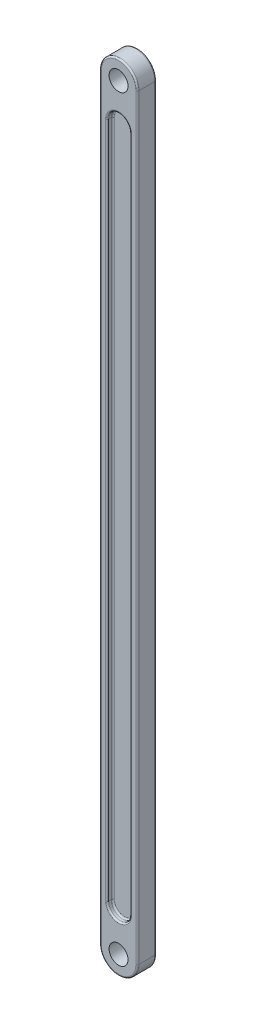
from build123d import *

# Parameters (mm, degrees)
SKETCH1_R      = 12.5
EXTRUDE1_DEPTH = 12.5
FILLET1_R      = 2
EXTRUDE2_START = 7.5
EXTRUDE2_DEPTH = 15
FILLET2_R      = 2


with BuildPart() as part:
    # Sketch1 → Extrude1 (new, symmetric)
    with BuildSketch(Plane.XY):
        with BuildLine():
            Line((25, 1000), (25, 0))
            ThreePointArc((25, 0), (0, -25), (-25, 0))
            Line((-25, 0), (-25, 1000))
            ThreePointArc((-25, 1000), (0, 1025), (25, 1000))
        make_face()
        Circle(SKETCH1_R, mode=Mode.SUBTRACT)
        with Locations((0, 1000)):
            Circle(SKETCH1_R, mode=Mode.SUBTRACT)
    extrude(amount=EXTRUDE1_DEPTH, both=True)

    # Fillet1
    fillet1_edges = [part.edges().sort_by_distance(p)[0] for p in [
        (0, -25, 12.5),
        (25, 500, 12.5),
        (0, 1025, 12.5),
        (25, 500, -12.5),
        (0, -25, -12.5),
        (-25, 500, -12.5),
        (0, 1025, -12.5),
        (-25, 500, 12.5),
    ]]
    fillet(fillet1_edges, radius=FILLET1_R)

    # Sketch2 → Extrude2 (cut)
    with BuildSketch(Plane(origin=(0, 0, -12.5), x_dir=(-1, 0, 0), z_dir=(0, 0, -1)).offset(EXTRUDE2_START)):
        with BuildLine():
            Line((15, 947.5), (15, 52.5))
            ThreePointArc((15, 52.5), (0, 37.5), (-15, 52.5))
            Line((-15, 52.5), (-15, 947.5))
            ThreePointArc((-15, 947.5), (0, 962.5), (15, 947.5))
        make_face()
    extrude2 = extrude(amount=-EXTRUDE2_DEPTH, mode=Mode.SUBTRACT)

    # Mirror1: Extrude2 across plane
    add(extrude2.mirror(Plane.XY), mode=Mode.SUBTRACT)

    # Fillet2
    fillet2_edges = [part.edges().sort_by_distance(p)[0] for p in [
        (15, 500, -12.5),
        (0, 37.5, -12.5),
        (-15, 500, -12.5),
        (0, 962.5, -12.5),
        (0, 962.5, -5),
        (0, 37.5, -5),
        (15, 500, -5),
        (-15, 500, -5),
        (-15, 500, 12.5),
        (0, 37.5, 12.5),
        (15, 500, 12.5),
        (0, 962.5, 12.5),
        (-15, 500, 5),
        (0, 962.5, 5),
        (15, 500, 5),
        (0, 37.5, 5),
    ]]
    fillet(fillet2_edges, radius=FILLET2_R)


solid = part.part
